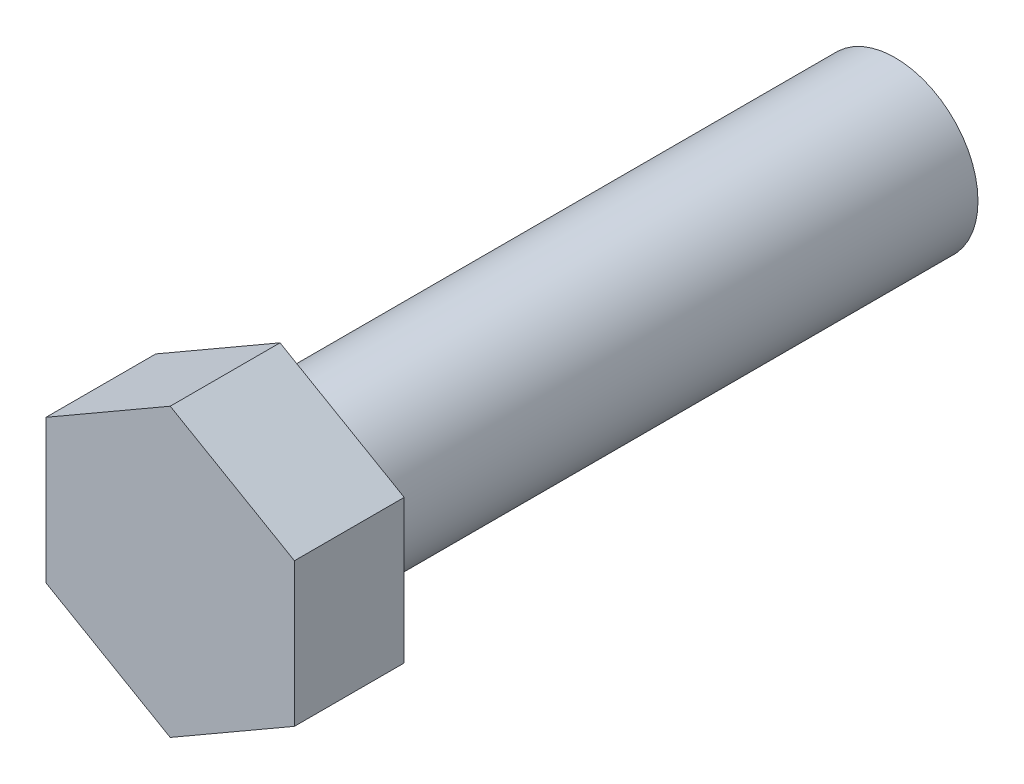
ISO-10303-21;
HEADER;
FILE_DESCRIPTION(('STEP AP214'),'2;1');
FILE_NAME('part.step','',(''),(''),'','','');
FILE_SCHEMA(('AUTOMOTIVE_DESIGN { 1 0 10303 214 1 1 1 1 }'));
ENDSEC;
DATA;
#1=APPLICATION_CONTEXT('core data for automotive mechanical design processes');
#2=APPLICATION_PROTOCOL_DEFINITION('international standard','automotive_design',2000,#1);
#3=PRODUCT_CONTEXT('',#1,'mechanical');
#4=PRODUCT('Part','Part','',(#3));
#5=PRODUCT_RELATED_PRODUCT_CATEGORY('part','',(#4));
#6=PRODUCT_DEFINITION_FORMATION('','',#4);
#7=PRODUCT_DEFINITION_CONTEXT('part definition',#1,'design');
#8=PRODUCT_DEFINITION('design','',#6,#7);
#9=PRODUCT_DEFINITION_SHAPE('','',#8);
#10=(LENGTH_UNIT() NAMED_UNIT(*) SI_UNIT(.MILLI.,.METRE.));
#11=(NAMED_UNIT(*) PLANE_ANGLE_UNIT() SI_UNIT($,.RADIAN.));
#12=(NAMED_UNIT(*) SI_UNIT($,.STERADIAN.) SOLID_ANGLE_UNIT());
#13=UNCERTAINTY_MEASURE_WITH_UNIT(LENGTH_MEASURE(1.E-05),#10,'distance_accuracy_value','');
#14=(GEOMETRIC_REPRESENTATION_CONTEXT(3) GLOBAL_UNCERTAINTY_ASSIGNED_CONTEXT((#13)) GLOBAL_UNIT_ASSIGNED_CONTEXT((#10,
#11,#12)) REPRESENTATION_CONTEXT('',''));
#15=CARTESIAN_POINT('',(0.,0.,0.));
#16=DIRECTION('',(0.,0.,1.));
#17=DIRECTION('',(1.,0.,0.));
#18=AXIS2_PLACEMENT_3D('',#15,#16,#17);
#19=CARTESIAN_POINT('',(33.3375,19.2474145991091,29.464));
#20=DIRECTION('',(-0.5,-0.866025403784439,0.));
#21=DIRECTION('',(0.866025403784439,-0.5,0.));
#22=AXIS2_PLACEMENT_3D('',#19,#20,#21);
#23=PLANE('',#22);
#24=DIRECTION('',(-0.866025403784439,0.5,0.));
#25=VECTOR('',#24,1.);
#26=CARTESIAN_POINT('',(33.3375,19.2474145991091,0.));
#27=LINE('',#26,#25);
#28=CARTESIAN_POINT('',(33.3375,19.2474145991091,0.));
#29=VERTEX_POINT('',#28);
#30=CARTESIAN_POINT('',(0.,38.4948291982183,0.));
#31=VERTEX_POINT('',#30);
#32=EDGE_CURVE('E130',#29,#31,#27,.T.);
#33=ORIENTED_EDGE('',*,*,#32,.T.);
#34=DIRECTION('',(0.,0.,-1.));
#35=VECTOR('',#34,1.);
#36=CARTESIAN_POINT('',(0.,38.4948291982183,29.464));
#37=LINE('',#36,#35);
#38=CARTESIAN_POINT('',(0.,38.4948291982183,29.464));
#39=VERTEX_POINT('',#38);
#40=EDGE_CURVE('E11',#39,#31,#37,.T.);
#41=ORIENTED_EDGE('',*,*,#40,.F.);
#42=DIRECTION('',(-0.866025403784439,0.5,0.));
#43=VECTOR('',#42,1.);
#44=CARTESIAN_POINT('',(33.3375,19.2474145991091,29.464));
#45=LINE('',#44,#43);
#46=CARTESIAN_POINT('',(33.3375,19.2474145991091,29.464));
#47=VERTEX_POINT('',#46);
#48=EDGE_CURVE('E137',#47,#39,#45,.T.);
#49=ORIENTED_EDGE('',*,*,#48,.F.);
#50=DIRECTION('',(0.,0.,-1.));
#51=VECTOR('',#50,1.);
#52=CARTESIAN_POINT('',(33.3375,19.2474145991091,29.464));
#53=LINE('',#52,#51);
#54=EDGE_CURVE('E124',#47,#29,#53,.T.);
#55=ORIENTED_EDGE('',*,*,#54,.T.);
#56=EDGE_LOOP('',(#33,#41,#49,#55));
#57=FACE_BOUND('',#56,.T.);
#58=ADVANCED_FACE('F43',(#57),#23,.F.);
#59=CARTESIAN_POINT('',(0.,38.4948291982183,29.464));
#60=DIRECTION('',(0.5,-0.866025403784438,0.));
#61=DIRECTION('',(0.866025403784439,0.5,0.));
#62=AXIS2_PLACEMENT_3D('',#59,#60,#61);
#63=PLANE('',#62);
#64=DIRECTION('',(-0.866025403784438,-0.5,0.));
#65=VECTOR('',#64,1.);
#66=CARTESIAN_POINT('',(0.,38.4948291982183,0.));
#67=LINE('',#66,#65);
#68=CARTESIAN_POINT('',(-33.3375,19.2474145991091,0.));
#69=VERTEX_POINT('',#68);
#70=EDGE_CURVE('E128',#31,#69,#67,.T.);
#71=ORIENTED_EDGE('',*,*,#70,.T.);
#72=DIRECTION('',(0.,0.,-1.));
#73=VECTOR('',#72,1.);
#74=CARTESIAN_POINT('',(-33.3375,19.2474145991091,29.464));
#75=LINE('',#74,#73);
#76=CARTESIAN_POINT('',(-33.3375,19.2474145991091,29.464));
#77=VERTEX_POINT('',#76);
#78=EDGE_CURVE('E51',#77,#69,#75,.T.);
#79=ORIENTED_EDGE('',*,*,#78,.F.);
#80=DIRECTION('',(-0.866025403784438,-0.5,0.));
#81=VECTOR('',#80,1.);
#82=CARTESIAN_POINT('',(0.,38.4948291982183,29.464));
#83=LINE('',#82,#81);
#84=EDGE_CURVE('E98',#39,#77,#83,.T.);
#85=ORIENTED_EDGE('',*,*,#84,.F.);
#86=ORIENTED_EDGE('',*,*,#40,.T.);
#87=EDGE_LOOP('',(#71,#79,#85,#86));
#88=FACE_BOUND('',#87,.T.);
#89=ADVANCED_FACE('F162',(#88),#63,.F.);
#90=CARTESIAN_POINT('',(-33.3375,19.2474145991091,29.464));
#91=DIRECTION('',(1.,0.,0.));
#92=DIRECTION('',(0.,0.,-1.));
#93=AXIS2_PLACEMENT_3D('',#90,#91,#92);
#94=PLANE('',#93);
#95=DIRECTION('',(0.,-1.,0.));
#96=VECTOR('',#95,1.);
#97=CARTESIAN_POINT('',(-33.3375,19.2474145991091,0.));
#98=LINE('',#97,#96);
#99=CARTESIAN_POINT('',(-33.3375,-19.2474145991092,0.));
#100=VERTEX_POINT('',#99);
#101=EDGE_CURVE('E133',#69,#100,#98,.T.);
#102=ORIENTED_EDGE('',*,*,#101,.T.);
#103=DIRECTION('',(0.,0.,-1.));
#104=VECTOR('',#103,1.);
#105=CARTESIAN_POINT('',(-33.3375,-19.2474145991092,29.464));
#106=LINE('',#105,#104);
#107=CARTESIAN_POINT('',(-33.3375,-19.2474145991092,29.464));
#108=VERTEX_POINT('',#107);
#109=EDGE_CURVE('E117',#108,#100,#106,.T.);
#110=ORIENTED_EDGE('',*,*,#109,.F.);
#111=DIRECTION('',(0.,-1.,0.));
#112=VECTOR('',#111,1.);
#113=CARTESIAN_POINT('',(-33.3375,19.2474145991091,29.464));
#114=LINE('',#113,#112);
#115=EDGE_CURVE('E107',#77,#108,#114,.T.);
#116=ORIENTED_EDGE('',*,*,#115,.F.);
#117=ORIENTED_EDGE('',*,*,#78,.T.);
#118=EDGE_LOOP('',(#102,#110,#116,#117));
#119=FACE_BOUND('',#118,.T.);
#120=ADVANCED_FACE('F144',(#119),#94,.F.);
#121=CARTESIAN_POINT('',(-33.3375,-19.2474145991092,29.464));
#122=DIRECTION('',(0.5,0.866025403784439,0.));
#123=DIRECTION('',(-0.866025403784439,0.5,0.));
#124=AXIS2_PLACEMENT_3D('',#121,#122,#123);
#125=PLANE('',#124);
#126=DIRECTION('',(0.866025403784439,-0.5,0.));
#127=VECTOR('',#126,1.);
#128=CARTESIAN_POINT('',(-33.3375,-19.2474145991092,0.));
#129=LINE('',#128,#127);
#130=CARTESIAN_POINT('',(0.,-38.4948291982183,0.));
#131=VERTEX_POINT('',#130);
#132=EDGE_CURVE('E120',#100,#131,#129,.T.);
#133=ORIENTED_EDGE('',*,*,#132,.T.);
#134=DIRECTION('',(0.,0.,-1.));
#135=VECTOR('',#134,1.);
#136=CARTESIAN_POINT('',(0.,-38.4948291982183,29.464));
#137=LINE('',#136,#135);
#138=CARTESIAN_POINT('',(0.,-38.4948291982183,29.464));
#139=VERTEX_POINT('',#138);
#140=EDGE_CURVE('E112',#139,#131,#137,.T.);
#141=ORIENTED_EDGE('',*,*,#140,.F.);
#142=DIRECTION('',(0.866025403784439,-0.5,0.));
#143=VECTOR('',#142,1.);
#144=CARTESIAN_POINT('',(-33.3375,-19.2474145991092,29.464));
#145=LINE('',#144,#143);
#146=EDGE_CURVE('E101',#108,#139,#145,.T.);
#147=ORIENTED_EDGE('',*,*,#146,.F.);
#148=ORIENTED_EDGE('',*,*,#109,.T.);
#149=EDGE_LOOP('',(#133,#141,#147,#148));
#150=FACE_BOUND('',#149,.T.);
#151=ADVANCED_FACE('F114',(#150),#125,.F.);
#152=CARTESIAN_POINT('',(0.,-38.4948291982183,29.464));
#153=DIRECTION('',(-0.5,0.866025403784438,0.));
#154=DIRECTION('',(-0.866025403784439,-0.5,0.));
#155=AXIS2_PLACEMENT_3D('',#152,#153,#154);
#156=PLANE('',#155);
#157=DIRECTION('',(0.866025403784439,0.5,0.));
#158=VECTOR('',#157,1.);
#159=CARTESIAN_POINT('',(0.,-38.4948291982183,0.));
#160=LINE('',#159,#158);
#161=CARTESIAN_POINT('',(33.3375,-19.2474145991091,0.));
#162=VERTEX_POINT('',#161);
#163=EDGE_CURVE('E85',#131,#162,#160,.T.);
#164=ORIENTED_EDGE('',*,*,#163,.T.);
#165=DIRECTION('',(0.,0.,-1.));
#166=VECTOR('',#165,1.);
#167=CARTESIAN_POINT('',(33.3375,-19.2474145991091,29.464));
#168=LINE('',#167,#166);
#169=CARTESIAN_POINT('',(33.3375,-19.2474145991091,29.464));
#170=VERTEX_POINT('',#169);
#171=EDGE_CURVE('E118',#170,#162,#168,.T.);
#172=ORIENTED_EDGE('',*,*,#171,.F.);
#173=DIRECTION('',(0.866025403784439,0.5,0.));
#174=VECTOR('',#173,1.);
#175=CARTESIAN_POINT('',(0.,-38.4948291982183,29.464));
#176=LINE('',#175,#174);
#177=EDGE_CURVE('E110',#139,#170,#176,.T.);
#178=ORIENTED_EDGE('',*,*,#177,.F.);
#179=ORIENTED_EDGE('',*,*,#140,.T.);
#180=EDGE_LOOP('',(#164,#172,#178,#179));
#181=FACE_BOUND('',#180,.T.);
#182=ADVANCED_FACE('F122',(#181),#156,.F.);
#183=CARTESIAN_POINT('',(33.3375,-19.2474145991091,29.464));
#184=DIRECTION('',(-1.,0.,0.));
#185=DIRECTION('',(0.,0.,1.));
#186=AXIS2_PLACEMENT_3D('',#183,#184,#185);
#187=PLANE('',#186);
#188=DIRECTION('',(0.,1.,0.));
#189=VECTOR('',#188,1.);
#190=CARTESIAN_POINT('',(33.3375,-19.2474145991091,0.));
#191=LINE('',#190,#189);
#192=EDGE_CURVE('E88',#162,#29,#191,.T.);
#193=ORIENTED_EDGE('',*,*,#192,.T.);
#194=ORIENTED_EDGE('',*,*,#54,.F.);
#195=DIRECTION('',(0.,1.,0.));
#196=VECTOR('',#195,1.);
#197=CARTESIAN_POINT('',(33.3375,-19.2474145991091,29.464));
#198=LINE('',#197,#196);
#199=EDGE_CURVE('E56',#170,#47,#198,.T.);
#200=ORIENTED_EDGE('',*,*,#199,.F.);
#201=ORIENTED_EDGE('',*,*,#171,.T.);
#202=EDGE_LOOP('',(#193,#194,#200,#201));
#203=FACE_BOUND('',#202,.T.);
#204=ADVANCED_FACE('F151',(#203),#187,.F.);
#205=CARTESIAN_POINT('',(0.,0.,29.464));
#206=DIRECTION('',(0.,0.,1.));
#207=DIRECTION('',(1.,0.,0.));
#208=AXIS2_PLACEMENT_3D('',#205,#206,#207);
#209=PLANE('',#208);
#210=ORIENTED_EDGE('',*,*,#48,.T.);
#211=ORIENTED_EDGE('',*,*,#84,.T.);
#212=ORIENTED_EDGE('',*,*,#115,.T.);
#213=ORIENTED_EDGE('',*,*,#146,.T.);
#214=ORIENTED_EDGE('',*,*,#177,.T.);
#215=ORIENTED_EDGE('',*,*,#199,.T.);
#216=EDGE_LOOP('',(#210,#211,#212,#213,#214,#215));
#217=FACE_BOUND('',#216,.T.);
#218=ADVANCED_FACE('F102',(#217),#209,.T.);
#219=CARTESIAN_POINT('',(0.,0.,0.));
#220=DIRECTION('',(0.,0.,1.));
#221=DIRECTION('',(1.,0.,0.));
#222=AXIS2_PLACEMENT_3D('',#219,#220,#221);
#223=PLANE('',#222);
#224=CARTESIAN_POINT('',(0.,0.,0.));
#225=DIRECTION('',(0.,0.,1.));
#226=DIRECTION('',(1.,0.,0.));
#227=AXIS2_PLACEMENT_3D('',#224,#225,#226);
#228=CIRCLE('',#227,22.225);
#229=CARTESIAN_POINT('',(22.225,0.,0.));
#230=VERTEX_POINT('',#229);
#231=EDGE_CURVE('E224',#230,#230,#228,.T.);
#232=ORIENTED_EDGE('',*,*,#231,.T.);
#233=EDGE_LOOP('',(#232));
#234=FACE_BOUND('',#233,.T.);
#235=ORIENTED_EDGE('',*,*,#32,.F.);
#236=ORIENTED_EDGE('',*,*,#192,.F.);
#237=ORIENTED_EDGE('',*,*,#163,.F.);
#238=ORIENTED_EDGE('',*,*,#132,.F.);
#239=ORIENTED_EDGE('',*,*,#101,.F.);
#240=ORIENTED_EDGE('',*,*,#70,.F.);
#241=EDGE_LOOP('',(#235,#236,#237,#238,#239,#240));
#242=FACE_BOUND('',#241,.T.);
#243=ADVANCED_FACE('F150',(#234,#242),#223,.F.);
#244=CARTESIAN_POINT('',(0.,0.,-165.1));
#245=DIRECTION('',(0.,0.,1.));
#246=DIRECTION('',(1.,0.,0.));
#247=AXIS2_PLACEMENT_3D('',#244,#245,#246);
#248=CYLINDRICAL_SURFACE('',#247,22.225);
#249=CARTESIAN_POINT('',(0.,0.,-165.1));
#250=DIRECTION('',(0.,0.,1.));
#251=DIRECTION('',(1.,0.,0.));
#252=AXIS2_PLACEMENT_3D('',#249,#250,#251);
#253=CIRCLE('',#252,22.225);
#254=CARTESIAN_POINT('',(22.225,0.,-165.1));
#255=VERTEX_POINT('',#254);
#256=EDGE_CURVE('E131',#255,#255,#253,.T.);
#257=ORIENTED_EDGE('',*,*,#256,.T.);
#258=EDGE_LOOP('',(#257));
#259=FACE_BOUND('',#258,.T.);
#260=ORIENTED_EDGE('',*,*,#231,.F.);
#261=EDGE_LOOP('',(#260));
#262=FACE_BOUND('',#261,.T.);
#263=ADVANCED_FACE('F201',(#259,#262),#248,.T.);
#264=CARTESIAN_POINT('',(0.,0.,-165.1));
#265=DIRECTION('',(0.,0.,1.));
#266=DIRECTION('',(1.,0.,0.));
#267=AXIS2_PLACEMENT_3D('',#264,#265,#266);
#268=PLANE('',#267);
#269=ORIENTED_EDGE('',*,*,#256,.F.);
#270=EDGE_LOOP('',(#269));
#271=FACE_BOUND('',#270,.T.);
#272=ADVANCED_FACE('F208',(#271),#268,.F.);
#273=CLOSED_SHELL('',(#58,#89,#120,#151,#182,#204,#218,#243,#263,#272));
#274=MANIFOLD_SOLID_BREP('B2',#273);
#275=ADVANCED_BREP_SHAPE_REPRESENTATION('',(#18,#274),#14);
#276=SHAPE_DEFINITION_REPRESENTATION(#9,#275);
ENDSEC;
END-ISO-10303-21;
